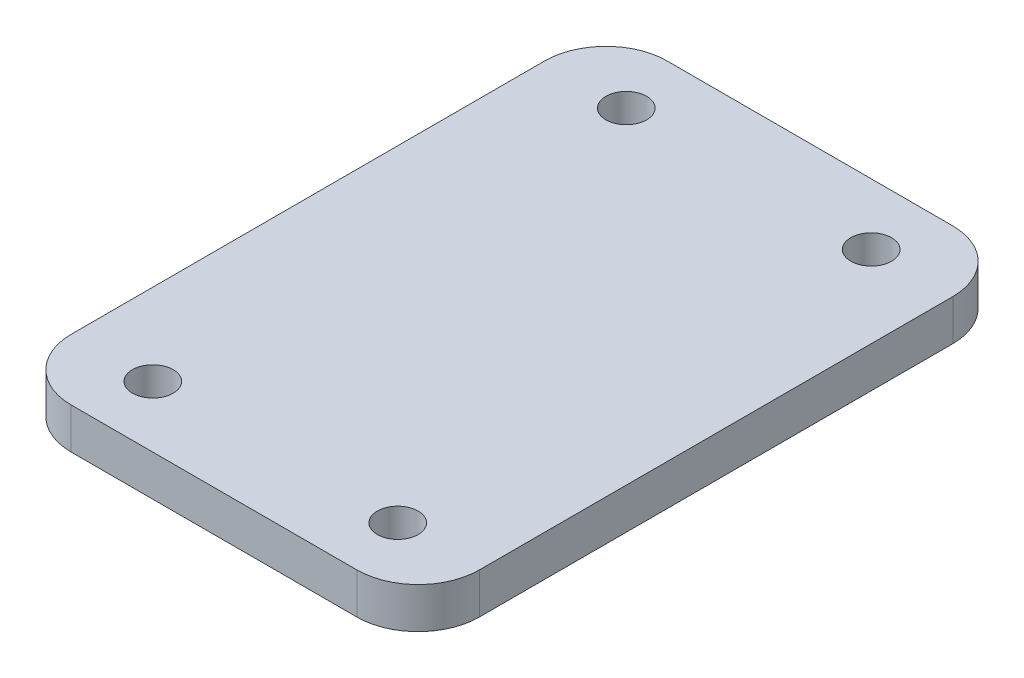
ISO-10303-21;
HEADER;
FILE_DESCRIPTION(('STEP AP214'),'2;1');
FILE_NAME('part.step','',(''),(''),'','','');
FILE_SCHEMA(('AUTOMOTIVE_DESIGN { 1 0 10303 214 1 1 1 1 }'));
ENDSEC;
DATA;
#1=APPLICATION_CONTEXT('core data for automotive mechanical design processes');
#2=APPLICATION_PROTOCOL_DEFINITION('international standard','automotive_design',2000,#1);
#3=PRODUCT_CONTEXT('',#1,'mechanical');
#4=PRODUCT('Part','Part','',(#3));
#5=PRODUCT_RELATED_PRODUCT_CATEGORY('part','',(#4));
#6=PRODUCT_DEFINITION_FORMATION('','',#4);
#7=PRODUCT_DEFINITION_CONTEXT('part definition',#1,'design');
#8=PRODUCT_DEFINITION('design','',#6,#7);
#9=PRODUCT_DEFINITION_SHAPE('','',#8);
#10=(LENGTH_UNIT() NAMED_UNIT(*) SI_UNIT(.MILLI.,.METRE.));
#11=(NAMED_UNIT(*) PLANE_ANGLE_UNIT() SI_UNIT($,.RADIAN.));
#12=(NAMED_UNIT(*) SI_UNIT($,.STERADIAN.) SOLID_ANGLE_UNIT());
#13=UNCERTAINTY_MEASURE_WITH_UNIT(LENGTH_MEASURE(1.E-05),#10,'distance_accuracy_value','');
#14=(GEOMETRIC_REPRESENTATION_CONTEXT(3) GLOBAL_UNCERTAINTY_ASSIGNED_CONTEXT((#13)) GLOBAL_UNIT_ASSIGNED_CONTEXT((#10,
#11,#12)) REPRESENTATION_CONTEXT('',''));
#15=CARTESIAN_POINT('',(0.,0.,0.));
#16=DIRECTION('',(0.,0.,1.));
#17=DIRECTION('',(1.,0.,0.));
#18=AXIS2_PLACEMENT_3D('',#15,#16,#17);
#19=CARTESIAN_POINT('',(50.,10.,73.));
#20=DIRECTION('',(-1.,0.,0.));
#21=DIRECTION('',(0.,0.,1.));
#22=AXIS2_PLACEMENT_3D('',#19,#20,#21);
#23=PLANE('',#22);
#24=DIRECTION('',(0.,0.,-1.));
#25=VECTOR('',#24,1.);
#26=CARTESIAN_POINT('',(50.,0.,73.));
#27=LINE('',#26,#25);
#28=CARTESIAN_POINT('',(50.,0.,58.));
#29=VERTEX_POINT('',#28);
#30=CARTESIAN_POINT('',(50.,0.,-58.));
#31=VERTEX_POINT('',#30);
#32=EDGE_CURVE('E136',#29,#31,#27,.T.);
#33=ORIENTED_EDGE('',*,*,#32,.T.);
#34=DIRECTION('',(0.,-1.,0.));
#35=VECTOR('',#34,1.);
#36=CARTESIAN_POINT('',(50.,10.,-58.));
#37=LINE('',#36,#35);
#38=CARTESIAN_POINT('',(50.,10.,-58.));
#39=VERTEX_POINT('',#38);
#40=EDGE_CURVE('E159',#31,#39,#37,.F.);
#41=ORIENTED_EDGE('',*,*,#40,.T.);
#42=DIRECTION('',(0.,0.,-1.));
#43=VECTOR('',#42,1.);
#44=CARTESIAN_POINT('',(50.,10.,73.));
#45=LINE('',#44,#43);
#46=CARTESIAN_POINT('',(50.,10.,58.));
#47=VERTEX_POINT('',#46);
#48=EDGE_CURVE('E134',#47,#39,#45,.T.);
#49=ORIENTED_EDGE('',*,*,#48,.F.);
#50=DIRECTION('',(0.,-1.,0.));
#51=VECTOR('',#50,1.);
#52=CARTESIAN_POINT('',(50.,10.,58.));
#53=LINE('',#52,#51);
#54=EDGE_CURVE('E156',#47,#29,#53,.T.);
#55=ORIENTED_EDGE('',*,*,#54,.T.);
#56=EDGE_LOOP('',(#33,#41,#49,#55));
#57=FACE_BOUND('',#56,.T.);
#58=ADVANCED_FACE('F41',(#57),#23,.F.);
#59=CARTESIAN_POINT('',(-50.,10.,-73.));
#60=DIRECTION('',(0.,0.,1.));
#61=DIRECTION('',(1.,0.,0.));
#62=AXIS2_PLACEMENT_3D('',#59,#60,#61);
#63=PLANE('',#62);
#64=DIRECTION('',(-1.,0.,0.));
#65=VECTOR('',#64,1.);
#66=CARTESIAN_POINT('',(-50.,0.,-73.));
#67=LINE('',#66,#65);
#68=CARTESIAN_POINT('',(35.,0.,-73.));
#69=VERTEX_POINT('',#68);
#70=CARTESIAN_POINT('',(-35.,0.,-73.));
#71=VERTEX_POINT('',#70);
#72=EDGE_CURVE('E132',#69,#71,#67,.T.);
#73=ORIENTED_EDGE('',*,*,#72,.T.);
#74=DIRECTION('',(0.,-1.,0.));
#75=VECTOR('',#74,1.);
#76=CARTESIAN_POINT('',(-35.,10.,-73.));
#77=LINE('',#76,#75);
#78=CARTESIAN_POINT('',(-35.,10.,-73.));
#79=VERTEX_POINT('',#78);
#80=EDGE_CURVE('E111',#71,#79,#77,.F.);
#81=ORIENTED_EDGE('',*,*,#80,.T.);
#82=DIRECTION('',(-1.,0.,0.));
#83=VECTOR('',#82,1.);
#84=CARTESIAN_POINT('',(-50.,10.,-73.));
#85=LINE('',#84,#83);
#86=CARTESIAN_POINT('',(35.,10.,-73.));
#87=VERTEX_POINT('',#86);
#88=EDGE_CURVE('E175',#87,#79,#85,.T.);
#89=ORIENTED_EDGE('',*,*,#88,.F.);
#90=DIRECTION('',(0.,-1.,0.));
#91=VECTOR('',#90,1.);
#92=CARTESIAN_POINT('',(35.,10.,-73.));
#93=LINE('',#92,#91);
#94=EDGE_CURVE('E116',#87,#69,#93,.T.);
#95=ORIENTED_EDGE('',*,*,#94,.T.);
#96=EDGE_LOOP('',(#73,#81,#89,#95));
#97=FACE_BOUND('',#96,.T.);
#98=ADVANCED_FACE('F230',(#97),#63,.F.);
#99=CARTESIAN_POINT('',(-50.,10.,73.));
#100=DIRECTION('',(1.,0.,0.));
#101=DIRECTION('',(0.,0.,-1.));
#102=AXIS2_PLACEMENT_3D('',#99,#100,#101);
#103=PLANE('',#102);
#104=DIRECTION('',(0.,0.,1.));
#105=VECTOR('',#104,1.);
#106=CARTESIAN_POINT('',(-50.,10.,73.));
#107=LINE('',#106,#105);
#108=CARTESIAN_POINT('',(-50.,10.,-58.));
#109=VERTEX_POINT('',#108);
#110=CARTESIAN_POINT('',(-50.,10.,58.));
#111=VERTEX_POINT('',#110);
#112=EDGE_CURVE('E125',#109,#111,#107,.T.);
#113=ORIENTED_EDGE('',*,*,#112,.F.);
#114=DIRECTION('',(0.,-1.,0.));
#115=VECTOR('',#114,1.);
#116=CARTESIAN_POINT('',(-50.,10.,-58.));
#117=LINE('',#116,#115);
#118=CARTESIAN_POINT('',(-50.,0.,-58.));
#119=VERTEX_POINT('',#118);
#120=EDGE_CURVE('E110',#109,#119,#117,.T.);
#121=ORIENTED_EDGE('',*,*,#120,.T.);
#122=DIRECTION('',(0.,0.,1.));
#123=VECTOR('',#122,1.);
#124=CARTESIAN_POINT('',(-50.,0.,73.));
#125=LINE('',#124,#123);
#126=CARTESIAN_POINT('',(-50.,0.,58.));
#127=VERTEX_POINT('',#126);
#128=EDGE_CURVE('E123',#119,#127,#125,.T.);
#129=ORIENTED_EDGE('',*,*,#128,.T.);
#130=DIRECTION('',(0.,-1.,0.));
#131=VECTOR('',#130,1.);
#132=CARTESIAN_POINT('',(-50.,10.,58.));
#133=LINE('',#132,#131);
#134=EDGE_CURVE('E127',#127,#111,#133,.F.);
#135=ORIENTED_EDGE('',*,*,#134,.T.);
#136=EDGE_LOOP('',(#113,#121,#129,#135));
#137=FACE_BOUND('',#136,.T.);
#138=ADVANCED_FACE('F122',(#137),#103,.F.);
#139=CARTESIAN_POINT('',(-50.,10.,73.));
#140=DIRECTION('',(0.,0.,-1.));
#141=DIRECTION('',(-1.,0.,0.));
#142=AXIS2_PLACEMENT_3D('',#139,#140,#141);
#143=PLANE('',#142);
#144=DIRECTION('',(1.,0.,0.));
#145=VECTOR('',#144,1.);
#146=CARTESIAN_POINT('',(-50.,0.,73.));
#147=LINE('',#146,#145);
#148=CARTESIAN_POINT('',(-35.,0.,73.));
#149=VERTEX_POINT('',#148);
#150=CARTESIAN_POINT('',(35.,0.,73.));
#151=VERTEX_POINT('',#150);
#152=EDGE_CURVE('E131',#149,#151,#147,.T.);
#153=ORIENTED_EDGE('',*,*,#152,.T.);
#154=DIRECTION('',(0.,-1.,0.));
#155=VECTOR('',#154,1.);
#156=CARTESIAN_POINT('',(35.,10.,73.));
#157=LINE('',#156,#155);
#158=CARTESIAN_POINT('',(35.,10.,73.));
#159=VERTEX_POINT('',#158);
#160=EDGE_CURVE('E11',#151,#159,#157,.F.);
#161=ORIENTED_EDGE('',*,*,#160,.T.);
#162=DIRECTION('',(1.,0.,0.));
#163=VECTOR('',#162,1.);
#164=CARTESIAN_POINT('',(-50.,10.,73.));
#165=LINE('',#164,#163);
#166=CARTESIAN_POINT('',(-35.,10.,73.));
#167=VERTEX_POINT('',#166);
#168=EDGE_CURVE('E140',#167,#159,#165,.T.);
#169=ORIENTED_EDGE('',*,*,#168,.F.);
#170=DIRECTION('',(0.,-1.,0.));
#171=VECTOR('',#170,1.);
#172=CARTESIAN_POINT('',(-35.,10.,73.));
#173=LINE('',#172,#171);
#174=EDGE_CURVE('E49',#167,#149,#173,.T.);
#175=ORIENTED_EDGE('',*,*,#174,.T.);
#176=EDGE_LOOP('',(#153,#161,#169,#175));
#177=FACE_BOUND('',#176,.T.);
#178=ADVANCED_FACE('F162',(#177),#143,.F.);
#179=CARTESIAN_POINT('',(0.,10.,0.));
#180=DIRECTION('',(0.,-1.,0.));
#181=DIRECTION('',(0.,0.,-1.));
#182=AXIS2_PLACEMENT_3D('',#179,#180,#181);
#183=PLANE('',#182);
#184=CARTESIAN_POINT('',(-30.,10.,-58.));
#185=DIRECTION('',(0.,1.,0.));
#186=DIRECTION('',(0.,0.,1.));
#187=AXIS2_PLACEMENT_3D('',#184,#185,#186);
#188=CIRCLE('',#187,5.);
#189=CARTESIAN_POINT('',(-30.,10.,-53.));
#190=VERTEX_POINT('',#189);
#191=EDGE_CURVE('E189',#190,#190,#188,.T.);
#192=ORIENTED_EDGE('',*,*,#191,.F.);
#193=EDGE_LOOP('',(#192));
#194=FACE_BOUND('',#193,.T.);
#195=CARTESIAN_POINT('',(30.,10.,58.));
#196=DIRECTION('',(0.,1.,0.));
#197=DIRECTION('',(0.,0.,1.));
#198=AXIS2_PLACEMENT_3D('',#195,#196,#197);
#199=CIRCLE('',#198,5.);
#200=CARTESIAN_POINT('',(30.,10.,63.));
#201=VERTEX_POINT('',#200);
#202=EDGE_CURVE('E198',#201,#201,#199,.T.);
#203=ORIENTED_EDGE('',*,*,#202,.F.);
#204=EDGE_LOOP('',(#203));
#205=FACE_BOUND('',#204,.T.);
#206=CARTESIAN_POINT('',(30.,10.,-58.));
#207=DIRECTION('',(0.,1.,0.));
#208=DIRECTION('',(0.,0.,1.));
#209=AXIS2_PLACEMENT_3D('',#206,#207,#208);
#210=CIRCLE('',#209,5.);
#211=CARTESIAN_POINT('',(30.,10.,-53.));
#212=VERTEX_POINT('',#211);
#213=EDGE_CURVE('E191',#212,#212,#210,.T.);
#214=ORIENTED_EDGE('',*,*,#213,.F.);
#215=EDGE_LOOP('',(#214));
#216=FACE_BOUND('',#215,.T.);
#217=CARTESIAN_POINT('',(-30.,10.,58.));
#218=DIRECTION('',(0.,1.,0.));
#219=DIRECTION('',(0.,0.,1.));
#220=AXIS2_PLACEMENT_3D('',#217,#218,#219);
#221=CIRCLE('',#220,5.);
#222=CARTESIAN_POINT('',(-30.,10.,63.));
#223=VERTEX_POINT('',#222);
#224=EDGE_CURVE('E180',#223,#223,#221,.T.);
#225=ORIENTED_EDGE('',*,*,#224,.F.);
#226=EDGE_LOOP('',(#225));
#227=FACE_BOUND('',#226,.T.);
#228=ORIENTED_EDGE('',*,*,#88,.T.);
#229=CARTESIAN_POINT('',(-35.,10.,-58.));
#230=DIRECTION('',(0.,-1.,0.));
#231=DIRECTION('',(0.,0.,-1.));
#232=AXIS2_PLACEMENT_3D('',#229,#230,#231);
#233=CIRCLE('',#232,15.);
#234=EDGE_CURVE('E154',#79,#109,#233,.F.);
#235=ORIENTED_EDGE('',*,*,#234,.T.);
#236=ORIENTED_EDGE('',*,*,#112,.T.);
#237=CARTESIAN_POINT('',(-35.,10.,58.));
#238=DIRECTION('',(0.,-1.,0.));
#239=DIRECTION('',(0.,0.,-1.));
#240=AXIS2_PLACEMENT_3D('',#237,#238,#239);
#241=CIRCLE('',#240,15.);
#242=EDGE_CURVE('E61',#111,#167,#241,.F.);
#243=ORIENTED_EDGE('',*,*,#242,.T.);
#244=ORIENTED_EDGE('',*,*,#168,.T.);
#245=CARTESIAN_POINT('',(35.,10.,58.));
#246=DIRECTION('',(0.,-1.,0.));
#247=DIRECTION('',(0.,0.,-1.));
#248=AXIS2_PLACEMENT_3D('',#245,#246,#247);
#249=CIRCLE('',#248,15.);
#250=EDGE_CURVE('E150',#159,#47,#249,.F.);
#251=ORIENTED_EDGE('',*,*,#250,.T.);
#252=ORIENTED_EDGE('',*,*,#48,.T.);
#253=CARTESIAN_POINT('',(35.,10.,-58.));
#254=DIRECTION('',(0.,-1.,0.));
#255=DIRECTION('',(0.,0.,-1.));
#256=AXIS2_PLACEMENT_3D('',#253,#254,#255);
#257=CIRCLE('',#256,15.);
#258=EDGE_CURVE('E152',#39,#87,#257,.F.);
#259=ORIENTED_EDGE('',*,*,#258,.T.);
#260=EDGE_LOOP('',(#228,#235,#236,#243,#244,#251,#252,#259));
#261=FACE_BOUND('',#260,.T.);
#262=ADVANCED_FACE('F218',(#194,#205,#216,#227,#261),#183,.F.);
#263=CARTESIAN_POINT('',(0.,0.,0.));
#264=DIRECTION('',(0.,-1.,0.));
#265=DIRECTION('',(0.,0.,-1.));
#266=AXIS2_PLACEMENT_3D('',#263,#264,#265);
#267=PLANE('',#266);
#268=CARTESIAN_POINT('',(-30.,0.,-58.));
#269=DIRECTION('',(0.,1.,0.));
#270=DIRECTION('',(0.,0.,1.));
#271=AXIS2_PLACEMENT_3D('',#268,#269,#270);
#272=CIRCLE('',#271,5.);
#273=CARTESIAN_POINT('',(-30.,0.,-53.));
#274=VERTEX_POINT('',#273);
#275=EDGE_CURVE('E201',#274,#274,#272,.T.);
#276=ORIENTED_EDGE('',*,*,#275,.T.);
#277=EDGE_LOOP('',(#276));
#278=FACE_BOUND('',#277,.T.);
#279=CARTESIAN_POINT('',(30.,0.,58.));
#280=DIRECTION('',(0.,1.,0.));
#281=DIRECTION('',(0.,0.,1.));
#282=AXIS2_PLACEMENT_3D('',#279,#280,#281);
#283=CIRCLE('',#282,5.);
#284=CARTESIAN_POINT('',(30.,0.,63.));
#285=VERTEX_POINT('',#284);
#286=EDGE_CURVE('E194',#285,#285,#283,.T.);
#287=ORIENTED_EDGE('',*,*,#286,.T.);
#288=EDGE_LOOP('',(#287));
#289=FACE_BOUND('',#288,.T.);
#290=CARTESIAN_POINT('',(30.,0.,-58.));
#291=DIRECTION('',(0.,1.,0.));
#292=DIRECTION('',(0.,0.,1.));
#293=AXIS2_PLACEMENT_3D('',#290,#291,#292);
#294=CIRCLE('',#293,5.);
#295=CARTESIAN_POINT('',(30.,0.,-53.));
#296=VERTEX_POINT('',#295);
#297=EDGE_CURVE('E195',#296,#296,#294,.T.);
#298=ORIENTED_EDGE('',*,*,#297,.T.);
#299=EDGE_LOOP('',(#298));
#300=FACE_BOUND('',#299,.T.);
#301=CARTESIAN_POINT('',(-30.,0.,58.));
#302=DIRECTION('',(0.,1.,0.));
#303=DIRECTION('',(0.,0.,1.));
#304=AXIS2_PLACEMENT_3D('',#301,#302,#303);
#305=CIRCLE('',#304,5.);
#306=CARTESIAN_POINT('',(-30.,0.,63.));
#307=VERTEX_POINT('',#306);
#308=EDGE_CURVE('E184',#307,#307,#305,.T.);
#309=ORIENTED_EDGE('',*,*,#308,.T.);
#310=EDGE_LOOP('',(#309));
#311=FACE_BOUND('',#310,.T.);
#312=ORIENTED_EDGE('',*,*,#128,.F.);
#313=CARTESIAN_POINT('',(-35.,0.,-58.));
#314=DIRECTION('',(0.,-1.,0.));
#315=DIRECTION('',(0.,0.,-1.));
#316=AXIS2_PLACEMENT_3D('',#313,#314,#315);
#317=CIRCLE('',#316,15.);
#318=EDGE_CURVE('E106',#119,#71,#317,.T.);
#319=ORIENTED_EDGE('',*,*,#318,.T.);
#320=ORIENTED_EDGE('',*,*,#72,.F.);
#321=CARTESIAN_POINT('',(35.,0.,-58.));
#322=DIRECTION('',(0.,-1.,0.));
#323=DIRECTION('',(0.,0.,-1.));
#324=AXIS2_PLACEMENT_3D('',#321,#322,#323);
#325=CIRCLE('',#324,15.);
#326=EDGE_CURVE('E117',#69,#31,#325,.T.);
#327=ORIENTED_EDGE('',*,*,#326,.T.);
#328=ORIENTED_EDGE('',*,*,#32,.F.);
#329=CARTESIAN_POINT('',(35.,0.,58.));
#330=DIRECTION('',(0.,-1.,0.));
#331=DIRECTION('',(0.,0.,-1.));
#332=AXIS2_PLACEMENT_3D('',#329,#330,#331);
#333=CIRCLE('',#332,15.);
#334=EDGE_CURVE('E143',#29,#151,#333,.T.);
#335=ORIENTED_EDGE('',*,*,#334,.T.);
#336=ORIENTED_EDGE('',*,*,#152,.F.);
#337=CARTESIAN_POINT('',(-35.,0.,58.));
#338=DIRECTION('',(0.,-1.,0.));
#339=DIRECTION('',(0.,0.,-1.));
#340=AXIS2_PLACEMENT_3D('',#337,#338,#339);
#341=CIRCLE('',#340,15.);
#342=EDGE_CURVE('E126',#149,#127,#341,.T.);
#343=ORIENTED_EDGE('',*,*,#342,.T.);
#344=EDGE_LOOP('',(#312,#319,#320,#327,#328,#335,#336,#343));
#345=FACE_BOUND('',#344,.T.);
#346=ADVANCED_FACE('F129',(#278,#289,#300,#311,#345),#267,.T.);
#347=CARTESIAN_POINT('',(-35.,10.,-58.));
#348=DIRECTION('',(0.,-1.,0.));
#349=DIRECTION('',(0.,0.,-1.));
#350=AXIS2_PLACEMENT_3D('',#347,#348,#349);
#351=CYLINDRICAL_SURFACE('',#350,15.);
#352=ORIENTED_EDGE('',*,*,#234,.F.);
#353=ORIENTED_EDGE('',*,*,#80,.F.);
#354=ORIENTED_EDGE('',*,*,#318,.F.);
#355=ORIENTED_EDGE('',*,*,#120,.F.);
#356=EDGE_LOOP('',(#352,#353,#354,#355));
#357=FACE_BOUND('',#356,.T.);
#358=ADVANCED_FACE('F109',(#357),#351,.T.);
#359=CARTESIAN_POINT('',(35.,10.,-58.));
#360=DIRECTION('',(0.,-1.,0.));
#361=DIRECTION('',(0.,0.,-1.));
#362=AXIS2_PLACEMENT_3D('',#359,#360,#361);
#363=CYLINDRICAL_SURFACE('',#362,15.);
#364=ORIENTED_EDGE('',*,*,#258,.F.);
#365=ORIENTED_EDGE('',*,*,#40,.F.);
#366=ORIENTED_EDGE('',*,*,#326,.F.);
#367=ORIENTED_EDGE('',*,*,#94,.F.);
#368=EDGE_LOOP('',(#364,#365,#366,#367));
#369=FACE_BOUND('',#368,.T.);
#370=ADVANCED_FACE('F232',(#369),#363,.T.);
#371=CARTESIAN_POINT('',(35.,10.,58.));
#372=DIRECTION('',(0.,-1.,0.));
#373=DIRECTION('',(0.,0.,-1.));
#374=AXIS2_PLACEMENT_3D('',#371,#372,#373);
#375=CYLINDRICAL_SURFACE('',#374,15.);
#376=ORIENTED_EDGE('',*,*,#250,.F.);
#377=ORIENTED_EDGE('',*,*,#160,.F.);
#378=ORIENTED_EDGE('',*,*,#334,.F.);
#379=ORIENTED_EDGE('',*,*,#54,.F.);
#380=EDGE_LOOP('',(#376,#377,#378,#379));
#381=FACE_BOUND('',#380,.T.);
#382=ADVANCED_FACE('F169',(#381),#375,.T.);
#383=CARTESIAN_POINT('',(-35.,10.,58.));
#384=DIRECTION('',(0.,-1.,0.));
#385=DIRECTION('',(0.,0.,-1.));
#386=AXIS2_PLACEMENT_3D('',#383,#384,#385);
#387=CYLINDRICAL_SURFACE('',#386,15.);
#388=ORIENTED_EDGE('',*,*,#242,.F.);
#389=ORIENTED_EDGE('',*,*,#134,.F.);
#390=ORIENTED_EDGE('',*,*,#342,.F.);
#391=ORIENTED_EDGE('',*,*,#174,.F.);
#392=EDGE_LOOP('',(#388,#389,#390,#391));
#393=FACE_BOUND('',#392,.T.);
#394=ADVANCED_FACE('F43',(#393),#387,.T.);
#395=CARTESIAN_POINT('',(-30.,0.,58.));
#396=DIRECTION('',(0.,1.,0.));
#397=DIRECTION('',(0.,0.,1.));
#398=AXIS2_PLACEMENT_3D('',#395,#396,#397);
#399=CYLINDRICAL_SURFACE('',#398,5.);
#400=ORIENTED_EDGE('',*,*,#308,.F.);
#401=EDGE_LOOP('',(#400));
#402=FACE_BOUND('',#401,.T.);
#403=ORIENTED_EDGE('',*,*,#224,.T.);
#404=EDGE_LOOP('',(#403));
#405=FACE_BOUND('',#404,.T.);
#406=ADVANCED_FACE('F253',(#402,#405),#399,.F.);
#407=CARTESIAN_POINT('',(30.,0.,-58.));
#408=DIRECTION('',(0.,1.,0.));
#409=DIRECTION('',(0.,0.,1.));
#410=AXIS2_PLACEMENT_3D('',#407,#408,#409);
#411=CYLINDRICAL_SURFACE('',#410,5.);
#412=ORIENTED_EDGE('',*,*,#297,.F.);
#413=EDGE_LOOP('',(#412));
#414=FACE_BOUND('',#413,.T.);
#415=ORIENTED_EDGE('',*,*,#213,.T.);
#416=EDGE_LOOP('',(#415));
#417=FACE_BOUND('',#416,.T.);
#418=ADVANCED_FACE('F256',(#414,#417),#411,.F.);
#419=CARTESIAN_POINT('',(30.,0.,58.));
#420=DIRECTION('',(0.,1.,0.));
#421=DIRECTION('',(0.,0.,1.));
#422=AXIS2_PLACEMENT_3D('',#419,#420,#421);
#423=CYLINDRICAL_SURFACE('',#422,5.);
#424=ORIENTED_EDGE('',*,*,#286,.F.);
#425=EDGE_LOOP('',(#424));
#426=FACE_BOUND('',#425,.T.);
#427=ORIENTED_EDGE('',*,*,#202,.T.);
#428=EDGE_LOOP('',(#427));
#429=FACE_BOUND('',#428,.T.);
#430=ADVANCED_FACE('F214',(#426,#429),#423,.F.);
#431=CARTESIAN_POINT('',(-30.,0.,-58.));
#432=DIRECTION('',(0.,1.,0.));
#433=DIRECTION('',(0.,0.,1.));
#434=AXIS2_PLACEMENT_3D('',#431,#432,#433);
#435=CYLINDRICAL_SURFACE('',#434,5.);
#436=ORIENTED_EDGE('',*,*,#275,.F.);
#437=EDGE_LOOP('',(#436));
#438=FACE_BOUND('',#437,.T.);
#439=ORIENTED_EDGE('',*,*,#191,.T.);
#440=EDGE_LOOP('',(#439));
#441=FACE_BOUND('',#440,.T.);
#442=ADVANCED_FACE('F211',(#438,#441),#435,.F.);
#443=CLOSED_SHELL('',(#58,#98,#138,#178,#262,#346,#358,#370,#382,#394,#406,#418,#430,#442));
#444=MANIFOLD_SOLID_BREP('B2',#443);
#445=ADVANCED_BREP_SHAPE_REPRESENTATION('',(#18,#444),#14);
#446=SHAPE_DEFINITION_REPRESENTATION(#9,#445);
ENDSEC;
END-ISO-10303-21;
